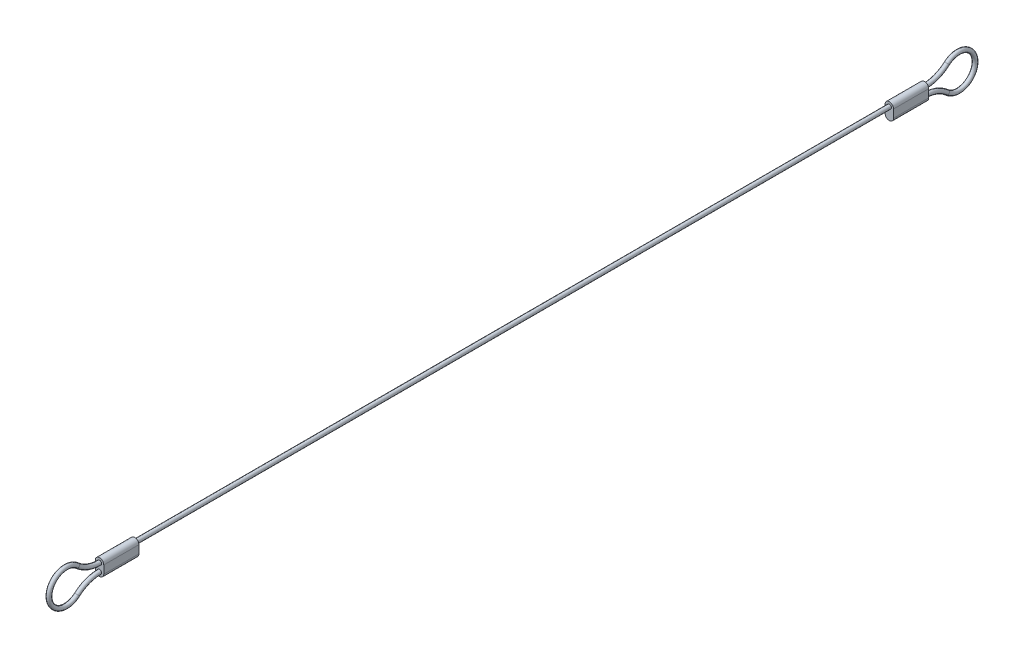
from build123d import *

# Parameters (mm, degrees)
SKETCH2_R           = 0.595
BOSS_EXTRUDE1_DEPTH = 10


with BuildPart() as part:
    # Sweep1: sweep along a path in Sketch1
    with BuildLine(Plane(origin=(0, 0, 0), x_dir=(0, 0, -1), z_dir=(1, 0, 0))) as sweep1_path:
        ThreePointArc((-117.4, -2.266252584), (-120.825492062, -2.898197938), (-123.8, -4.710835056))
        ThreePointArc((-123.8, -4.710835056), (-131.8, -1.133126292), (-123.8, 2.444582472))
        ThreePointArc((-123.8, 2.444582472), (-120.825492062, 0.631945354), (-117.4, 0))
        Line((-117.4, 0), (117.4, 0))
        ThreePointArc((117.4, 0), (120.825492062, 0.631945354), (123.8, 2.444582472))
        ThreePointArc((123.8, 2.444582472), (131.8, -1.133126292), (123.8, -4.710835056))
        ThreePointArc((123.8, -4.710835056), (120.825492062, -2.898197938), (117.4, -2.266252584))
    # Sketch2 → Sweep1 (sweep)
    with BuildSketch(Plane.XY):
        Circle(SKETCH2_R)
    sweep(path=sweep1_path.line)

    # Sketch3 → Boss-Extrude1 (add)
    with BuildSketch(Plane(origin=(0, 0, 117.4), x_dir=(-1, 0, 0), z_dir=(0, 0, -1))):
        with BuildLine():
            Line((1.2, 0), (1.2, -2.266252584))
            ThreePointArc((1.2, -2.266252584), (0, -3.466252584), (-1.2, -2.266252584))
            Line((-1.2, -2.266252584), (-1.2, 0))
            ThreePointArc((-1.2, 0), (0, 1.2), (1.2, 0))
        make_face()
    boss_extrude1 = extrude(amount=BOSS_EXTRUDE1_DEPTH)

    # Mirror1: Boss-Extrude1 across plane
    add(boss_extrude1.mirror(Plane.XY))


solid = part.part
